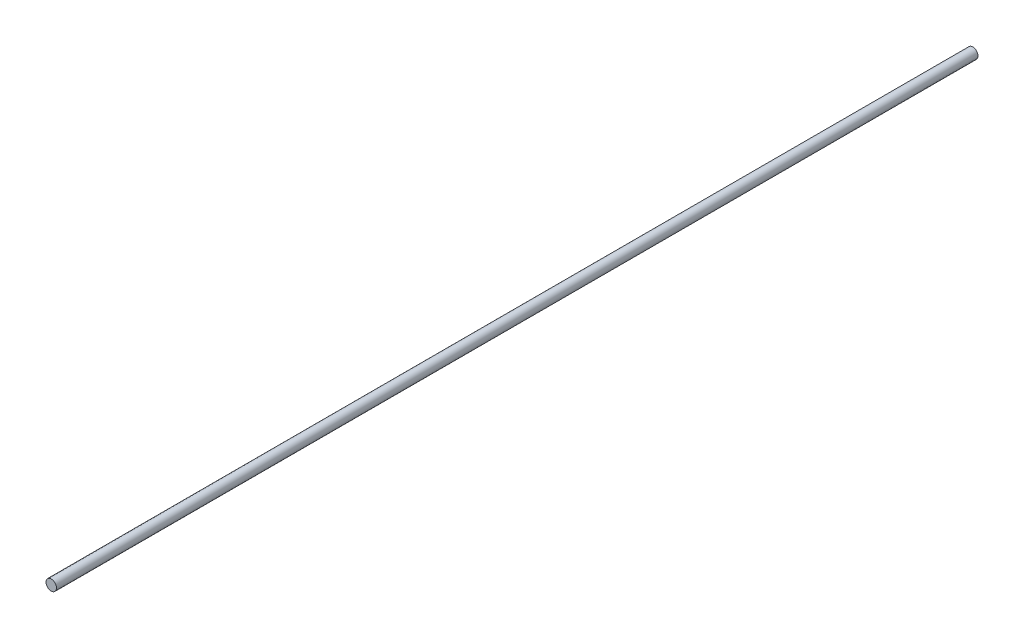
ISO-10303-21;
HEADER;
FILE_DESCRIPTION(('STEP AP214'),'2;1');
FILE_NAME('part.step','',(''),(''),'','','');
FILE_SCHEMA(('AUTOMOTIVE_DESIGN { 1 0 10303 214 1 1 1 1 }'));
ENDSEC;
DATA;
#1=APPLICATION_CONTEXT('core data for automotive mechanical design processes');
#2=APPLICATION_PROTOCOL_DEFINITION('international standard','automotive_design',2000,#1);
#3=PRODUCT_CONTEXT('',#1,'mechanical');
#4=PRODUCT('Part','Part','',(#3));
#5=PRODUCT_RELATED_PRODUCT_CATEGORY('part','',(#4));
#6=PRODUCT_DEFINITION_FORMATION('','',#4);
#7=PRODUCT_DEFINITION_CONTEXT('part definition',#1,'design');
#8=PRODUCT_DEFINITION('design','',#6,#7);
#9=PRODUCT_DEFINITION_SHAPE('','',#8);
#10=(LENGTH_UNIT() NAMED_UNIT(*) SI_UNIT(.MILLI.,.METRE.));
#11=(NAMED_UNIT(*) PLANE_ANGLE_UNIT() SI_UNIT($,.RADIAN.));
#12=(NAMED_UNIT(*) SI_UNIT($,.STERADIAN.) SOLID_ANGLE_UNIT());
#13=UNCERTAINTY_MEASURE_WITH_UNIT(LENGTH_MEASURE(1.E-05),#10,'distance_accuracy_value','');
#14=(GEOMETRIC_REPRESENTATION_CONTEXT(3) GLOBAL_UNCERTAINTY_ASSIGNED_CONTEXT((#13)) GLOBAL_UNIT_ASSIGNED_CONTEXT((#10,
#11,#12)) REPRESENTATION_CONTEXT('',''));
#15=CARTESIAN_POINT('',(0.,0.,0.));
#16=DIRECTION('',(0.,0.,1.));
#17=DIRECTION('',(1.,0.,0.));
#18=AXIS2_PLACEMENT_3D('',#15,#16,#17);
#19=CARTESIAN_POINT('',(0.,0.,440.));
#20=DIRECTION('',(0.,0.,-1.));
#21=DIRECTION('',(-1.,0.,0.));
#22=AXIS2_PLACEMENT_3D('',#19,#20,#21);
#23=CYLINDRICAL_SURFACE('',#22,2.5);
#24=CARTESIAN_POINT('',(0.,0.,440.));
#25=DIRECTION('',(0.,0.,1.));
#26=DIRECTION('',(1.,0.,0.));
#27=AXIS2_PLACEMENT_3D('',#24,#25,#26);
#28=CIRCLE('',#27,2.5);
#29=CARTESIAN_POINT('',(2.5,0.,440.));
#30=VERTEX_POINT('',#29);
#31=EDGE_CURVE('E10',#30,#30,#28,.T.);
#32=ORIENTED_EDGE('',*,*,#31,.F.);
#33=EDGE_LOOP('',(#32));
#34=FACE_BOUND('',#33,.T.);
#35=CARTESIAN_POINT('',(0.,0.,0.));
#36=DIRECTION('',(0.,0.,1.));
#37=DIRECTION('',(1.,0.,0.));
#38=AXIS2_PLACEMENT_3D('',#35,#36,#37);
#39=CIRCLE('',#38,2.5);
#40=CARTESIAN_POINT('',(2.5,0.,0.));
#41=VERTEX_POINT('',#40);
#42=EDGE_CURVE('E40',#41,#41,#39,.T.);
#43=ORIENTED_EDGE('',*,*,#42,.T.);
#44=EDGE_LOOP('',(#43));
#45=FACE_BOUND('',#44,.T.);
#46=ADVANCED_FACE('F37',(#34,#45),#23,.T.);
#47=CARTESIAN_POINT('',(0.,0.,440.));
#48=DIRECTION('',(0.,0.,1.));
#49=DIRECTION('',(1.,0.,0.));
#50=AXIS2_PLACEMENT_3D('',#47,#48,#49);
#51=PLANE('',#50);
#52=ORIENTED_EDGE('',*,*,#31,.T.);
#53=EDGE_LOOP('',(#52));
#54=FACE_BOUND('',#53,.T.);
#55=ADVANCED_FACE('F54',(#54),#51,.T.);
#56=CARTESIAN_POINT('',(0.,0.,0.));
#57=DIRECTION('',(0.,0.,1.));
#58=DIRECTION('',(1.,0.,0.));
#59=AXIS2_PLACEMENT_3D('',#56,#57,#58);
#60=PLANE('',#59);
#61=ORIENTED_EDGE('',*,*,#42,.F.);
#62=EDGE_LOOP('',(#61));
#63=FACE_BOUND('',#62,.T.);
#64=ADVANCED_FACE('F52',(#63),#60,.F.);
#65=CLOSED_SHELL('',(#46,#55,#64));
#66=MANIFOLD_SOLID_BREP('B2',#65);
#67=ADVANCED_BREP_SHAPE_REPRESENTATION('',(#18,#66),#14);
#68=SHAPE_DEFINITION_REPRESENTATION(#9,#67);
ENDSEC;
END-ISO-10303-21;
